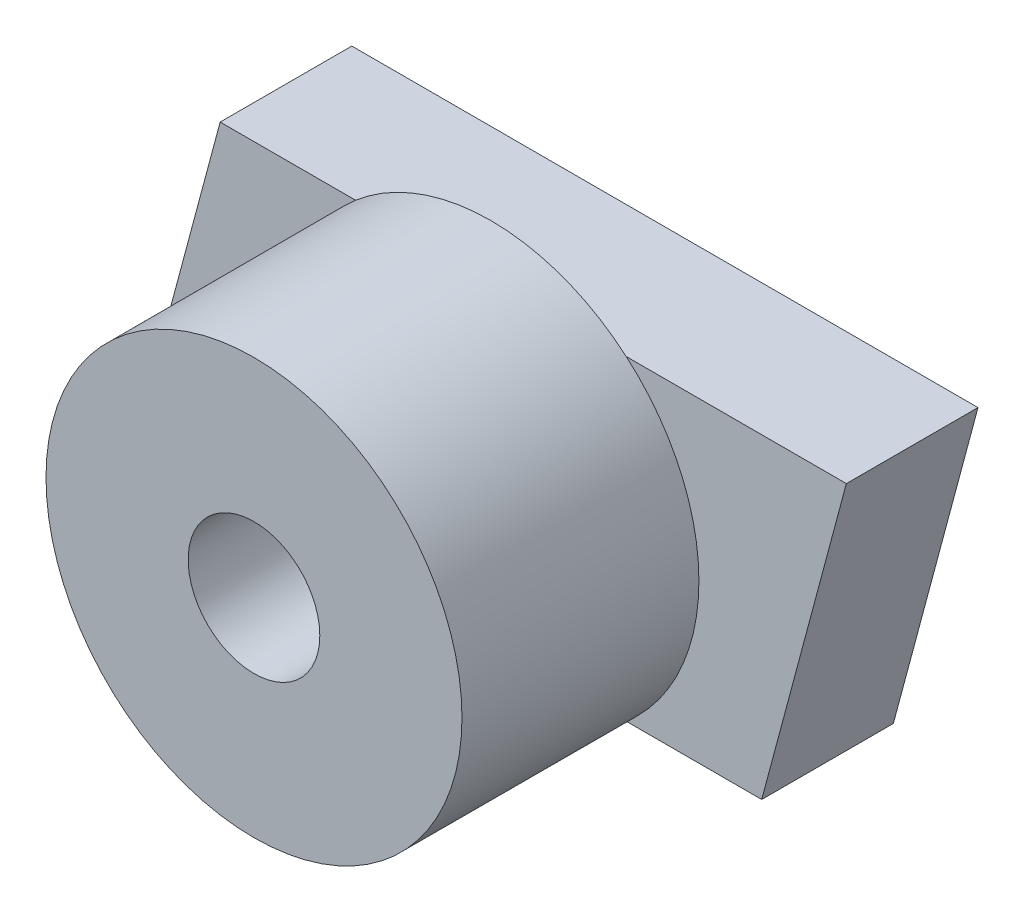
ISO-10303-21;
HEADER;
FILE_DESCRIPTION(('STEP AP214'),'2;1');
FILE_NAME('part.step','',(''),(''),'','','');
FILE_SCHEMA(('AUTOMOTIVE_DESIGN { 1 0 10303 214 1 1 1 1 }'));
ENDSEC;
DATA;
#1=APPLICATION_CONTEXT('core data for automotive mechanical design processes');
#2=APPLICATION_PROTOCOL_DEFINITION('international standard','automotive_design',2000,#1);
#3=PRODUCT_CONTEXT('',#1,'mechanical');
#4=PRODUCT('Part','Part','',(#3));
#5=PRODUCT_RELATED_PRODUCT_CATEGORY('part','',(#4));
#6=PRODUCT_DEFINITION_FORMATION('','',#4);
#7=PRODUCT_DEFINITION_CONTEXT('part definition',#1,'design');
#8=PRODUCT_DEFINITION('design','',#6,#7);
#9=PRODUCT_DEFINITION_SHAPE('','',#8);
#10=(LENGTH_UNIT() NAMED_UNIT(*) SI_UNIT(.MILLI.,.METRE.));
#11=(NAMED_UNIT(*) PLANE_ANGLE_UNIT() SI_UNIT($,.RADIAN.));
#12=(NAMED_UNIT(*) SI_UNIT($,.STERADIAN.) SOLID_ANGLE_UNIT());
#13=UNCERTAINTY_MEASURE_WITH_UNIT(LENGTH_MEASURE(1.E-05),#10,'distance_accuracy_value','');
#14=(GEOMETRIC_REPRESENTATION_CONTEXT(3) GLOBAL_UNCERTAINTY_ASSIGNED_CONTEXT((#13)) GLOBAL_UNIT_ASSIGNED_CONTEXT((#10,
#11,#12)) REPRESENTATION_CONTEXT('',''));
#15=CARTESIAN_POINT('',(0.,0.,0.));
#16=DIRECTION('',(0.,0.,1.));
#17=DIRECTION('',(1.,0.,0.));
#18=AXIS2_PLACEMENT_3D('',#15,#16,#17);
#19=CARTESIAN_POINT('',(-6.05198096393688,-0.400190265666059,-5.));
#20=DIRECTION('',(0.,0.,1.));
#21=DIRECTION('',(1.,0.,0.));
#22=AXIS2_PLACEMENT_3D('',#19,#20,#21);
#23=PLANE('',#22);
#24=CARTESIAN_POINT('',(0.,0.,-5.));
#25=DIRECTION('',(0.,0.,1.));
#26=DIRECTION('',(1.,0.,0.));
#27=AXIS2_PLACEMENT_3D('',#24,#25,#26);
#28=CIRCLE('',#27,2.5);
#29=CARTESIAN_POINT('',(2.5,0.,-5.));
#30=VERTEX_POINT('',#29);
#31=EDGE_CURVE('E88',#30,#30,#28,.T.);
#32=ORIENTED_EDGE('',*,*,#31,.T.);
#33=EDGE_LOOP('',(#32));
#34=FACE_BOUND('',#33,.T.);
#35=DIRECTION('',(-0.258819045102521,-0.965925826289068,0.));
#36=VECTOR('',#35,1.);
#37=CARTESIAN_POINT('',(-10.2846096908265,6.,-5.));
#38=LINE('',#37,#36);
#39=CARTESIAN_POINT('',(-10.2846096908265,6.,-5.));
#40=VERTEX_POINT('',#39);
#41=CARTESIAN_POINT('',(-13.5,-6.,-5.));
#42=VERTEX_POINT('',#41);
#43=EDGE_CURVE('E76',#40,#42,#38,.T.);
#44=ORIENTED_EDGE('',*,*,#43,.F.);
#45=DIRECTION('',(1.,0.,0.));
#46=VECTOR('',#45,1.);
#47=CARTESIAN_POINT('',(0.,6.,-5.));
#48=LINE('',#47,#46);
#49=CARTESIAN_POINT('',(13.5,6.,-5.));
#50=VERTEX_POINT('',#49);
#51=EDGE_CURVE('E72',#50,#40,#48,.F.);
#52=ORIENTED_EDGE('',*,*,#51,.F.);
#53=DIRECTION('',(0.258819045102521,0.965925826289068,0.));
#54=VECTOR('',#53,1.);
#55=CARTESIAN_POINT('',(10.2846096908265,-6.,-5.));
#56=LINE('',#55,#54);
#57=CARTESIAN_POINT('',(10.2846096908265,-6.,-5.));
#58=VERTEX_POINT('',#57);
#59=EDGE_CURVE('E74',#58,#50,#56,.T.);
#60=ORIENTED_EDGE('',*,*,#59,.F.);
#61=DIRECTION('',(1.,0.,0.));
#62=VECTOR('',#61,1.);
#63=CARTESIAN_POINT('',(-13.5,-6.,-5.));
#64=LINE('',#63,#62);
#65=EDGE_CURVE('E108',#42,#58,#64,.T.);
#66=ORIENTED_EDGE('',*,*,#65,.F.);
#67=EDGE_LOOP('',(#44,#52,#60,#66));
#68=FACE_BOUND('',#67,.T.);
#69=ADVANCED_FACE('F14',(#34,#68),#23,.F.);
#70=CARTESIAN_POINT('',(10.2846096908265,-6.,-5.));
#71=DIRECTION('',(0.965925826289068,-0.258819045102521,0.));
#72=DIRECTION('',(0.258819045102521,0.965925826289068,0.));
#73=AXIS2_PLACEMENT_3D('',#70,#71,#72);
#74=PLANE('',#73);
#75=DIRECTION('',(0.258819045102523,0.965925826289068,0.));
#76=VECTOR('',#75,1.);
#77=CARTESIAN_POINT('',(10.2846096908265,-6.,0.));
#78=LINE('',#77,#76);
#79=CARTESIAN_POINT('',(10.2846096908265,-6.,0.));
#80=VERTEX_POINT('',#79);
#81=CARTESIAN_POINT('',(13.5,6.,0.));
#82=VERTEX_POINT('',#81);
#83=EDGE_CURVE('E103',#80,#82,#78,.T.);
#84=ORIENTED_EDGE('',*,*,#83,.F.);
#85=DIRECTION('',(0.,0.,-1.));
#86=VECTOR('',#85,1.);
#87=CARTESIAN_POINT('',(10.2846096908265,-6.,-5.));
#88=LINE('',#87,#86);
#89=EDGE_CURVE('E86',#58,#80,#88,.F.);
#90=ORIENTED_EDGE('',*,*,#89,.F.);
#91=ORIENTED_EDGE('',*,*,#59,.T.);
#92=DIRECTION('',(0.,0.,1.));
#93=VECTOR('',#92,1.);
#94=CARTESIAN_POINT('',(13.5,6.,-5.));
#95=LINE('',#94,#93);
#96=EDGE_CURVE('E80',#82,#50,#95,.F.);
#97=ORIENTED_EDGE('',*,*,#96,.F.);
#98=EDGE_LOOP('',(#84,#90,#91,#97));
#99=FACE_BOUND('',#98,.T.);
#100=ADVANCED_FACE('F84',(#99),#74,.T.);
#101=CARTESIAN_POINT('',(0.,6.,-5.));
#102=DIRECTION('',(0.,1.,0.));
#103=DIRECTION('',(0.,0.,1.));
#104=AXIS2_PLACEMENT_3D('',#101,#102,#103);
#105=PLANE('',#104);
#106=DIRECTION('',(1.,0.,0.));
#107=VECTOR('',#106,1.);
#108=CARTESIAN_POINT('',(-6.05198096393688,6.,0.));
#109=LINE('',#108,#107);
#110=CARTESIAN_POINT('',(5.13906606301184,6.,0.));
#111=VERTEX_POINT('',#110);
#112=EDGE_CURVE('E92',#82,#111,#109,.F.);
#113=ORIENTED_EDGE('',*,*,#112,.F.);
#114=ORIENTED_EDGE('',*,*,#96,.T.);
#115=ORIENTED_EDGE('',*,*,#51,.T.);
#116=DIRECTION('',(0.,0.,1.));
#117=VECTOR('',#116,1.);
#118=CARTESIAN_POINT('',(-10.2846096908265,6.,-5.));
#119=LINE('',#118,#117);
#120=CARTESIAN_POINT('',(-10.2846096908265,6.,0.));
#121=VERTEX_POINT('',#120);
#122=EDGE_CURVE('E95',#121,#40,#119,.F.);
#123=ORIENTED_EDGE('',*,*,#122,.F.);
#124=DIRECTION('',(1.,0.,0.));
#125=VECTOR('',#124,1.);
#126=CARTESIAN_POINT('',(-6.05198096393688,6.,0.));
#127=LINE('',#126,#125);
#128=CARTESIAN_POINT('',(-5.13906606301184,6.,0.));
#129=VERTEX_POINT('',#128);
#130=EDGE_CURVE('E139',#129,#121,#127,.F.);
#131=ORIENTED_EDGE('',*,*,#130,.F.);
#132=DIRECTION('',(1.,0.,0.));
#133=VECTOR('',#132,1.);
#134=CARTESIAN_POINT('',(0.,6.,0.));
#135=LINE('',#134,#133);
#136=EDGE_CURVE('E142',#129,#111,#135,.T.);
#137=ORIENTED_EDGE('',*,*,#136,.T.);
#138=EDGE_LOOP('',(#113,#114,#115,#123,#131,#137));
#139=FACE_BOUND('',#138,.T.);
#140=ADVANCED_FACE('F90',(#139),#105,.T.);
#141=CARTESIAN_POINT('',(-10.2846096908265,6.,-5.));
#142=DIRECTION('',(-0.965925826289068,0.258819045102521,0.));
#143=DIRECTION('',(-0.258819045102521,-0.965925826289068,0.));
#144=AXIS2_PLACEMENT_3D('',#141,#142,#143);
#145=PLANE('',#144);
#146=DIRECTION('',(-0.258819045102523,-0.965925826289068,0.));
#147=VECTOR('',#146,1.);
#148=CARTESIAN_POINT('',(-10.2846096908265,6.,0.));
#149=LINE('',#148,#147);
#150=CARTESIAN_POINT('',(-13.5,-6.,0.));
#151=VERTEX_POINT('',#150);
#152=EDGE_CURVE('E132',#121,#151,#149,.T.);
#153=ORIENTED_EDGE('',*,*,#152,.F.);
#154=ORIENTED_EDGE('',*,*,#122,.T.);
#155=ORIENTED_EDGE('',*,*,#43,.T.);
#156=DIRECTION('',(0.,0.,-1.));
#157=VECTOR('',#156,1.);
#158=CARTESIAN_POINT('',(-13.5,-6.,-5.));
#159=LINE('',#158,#157);
#160=EDGE_CURVE('E53',#151,#42,#159,.T.);
#161=ORIENTED_EDGE('',*,*,#160,.F.);
#162=EDGE_LOOP('',(#153,#154,#155,#161));
#163=FACE_BOUND('',#162,.T.);
#164=ADVANCED_FACE('F158',(#163),#145,.T.);
#165=CARTESIAN_POINT('',(-13.5,-6.,-5.));
#166=DIRECTION('',(0.,-1.,0.));
#167=DIRECTION('',(0.,0.,-1.));
#168=AXIS2_PLACEMENT_3D('',#165,#166,#167);
#169=PLANE('',#168);
#170=DIRECTION('',(1.,0.,0.));
#171=VECTOR('',#170,1.);
#172=CARTESIAN_POINT('',(-6.05198096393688,-6.,0.));
#173=LINE('',#172,#171);
#174=CARTESIAN_POINT('',(-5.13906606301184,-6.,0.));
#175=VERTEX_POINT('',#174);
#176=EDGE_CURVE('E130',#151,#175,#173,.T.);
#177=ORIENTED_EDGE('',*,*,#176,.F.);
#178=ORIENTED_EDGE('',*,*,#160,.T.);
#179=ORIENTED_EDGE('',*,*,#65,.T.);
#180=ORIENTED_EDGE('',*,*,#89,.T.);
#181=DIRECTION('',(1.,0.,0.));
#182=VECTOR('',#181,1.);
#183=CARTESIAN_POINT('',(-6.05198096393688,-6.,0.));
#184=LINE('',#183,#182);
#185=CARTESIAN_POINT('',(5.13906606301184,-6.,0.));
#186=VERTEX_POINT('',#185);
#187=EDGE_CURVE('E43',#186,#80,#184,.T.);
#188=ORIENTED_EDGE('',*,*,#187,.F.);
#189=DIRECTION('',(1.,0.,0.));
#190=VECTOR('',#189,1.);
#191=CARTESIAN_POINT('',(0.,-6.,0.));
#192=LINE('',#191,#190);
#193=EDGE_CURVE('E32',#186,#175,#192,.F.);
#194=ORIENTED_EDGE('',*,*,#193,.T.);
#195=EDGE_LOOP('',(#177,#178,#179,#180,#188,#194));
#196=FACE_BOUND('',#195,.T.);
#197=ADVANCED_FACE('F194',(#196),#169,.T.);
#198=CARTESIAN_POINT('',(0.,0.,9.));
#199=DIRECTION('',(0.,0.,1.));
#200=DIRECTION('',(1.,0.,0.));
#201=AXIS2_PLACEMENT_3D('',#198,#199,#200);
#202=PLANE('',#201);
#203=CARTESIAN_POINT('',(0.,0.,9.));
#204=DIRECTION('',(0.,0.,1.));
#205=DIRECTION('',(1.,0.,0.));
#206=AXIS2_PLACEMENT_3D('',#203,#204,#205);
#207=CIRCLE('',#206,2.5);
#208=CARTESIAN_POINT('',(2.5,0.,9.));
#209=VERTEX_POINT('',#208);
#210=EDGE_CURVE('E213',#209,#209,#207,.T.);
#211=ORIENTED_EDGE('',*,*,#210,.F.);
#212=EDGE_LOOP('',(#211));
#213=FACE_BOUND('',#212,.T.);
#214=CARTESIAN_POINT('',(0.,0.,9.));
#215=DIRECTION('',(0.,0.,1.));
#216=DIRECTION('',(1.,0.,0.));
#217=AXIS2_PLACEMENT_3D('',#214,#215,#216);
#218=CIRCLE('',#217,7.9);
#219=CARTESIAN_POINT('',(7.9,0.,9.));
#220=VERTEX_POINT('',#219);
#221=EDGE_CURVE('E17',#220,#220,#218,.F.);
#222=ORIENTED_EDGE('',*,*,#221,.F.);
#223=EDGE_LOOP('',(#222));
#224=FACE_BOUND('',#223,.T.);
#225=ADVANCED_FACE('F190',(#213,#224),#202,.T.);
#226=CARTESIAN_POINT('',(-6.05198096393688,-0.400190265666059,0.));
#227=DIRECTION('',(0.,0.,1.));
#228=DIRECTION('',(1.,0.,0.));
#229=AXIS2_PLACEMENT_3D('',#226,#227,#228);
#230=PLANE('',#229);
#231=ORIENTED_EDGE('',*,*,#83,.T.);
#232=ORIENTED_EDGE('',*,*,#112,.T.);
#233=CARTESIAN_POINT('',(0.,0.,0.));
#234=DIRECTION('',(0.,0.,1.));
#235=DIRECTION('',(1.,0.,0.));
#236=AXIS2_PLACEMENT_3D('',#233,#234,#235);
#237=CIRCLE('',#236,7.9);
#238=EDGE_CURVE('E124',#186,#111,#237,.T.);
#239=ORIENTED_EDGE('',*,*,#238,.F.);
#240=ORIENTED_EDGE('',*,*,#187,.T.);
#241=EDGE_LOOP('',(#231,#232,#239,#240));
#242=FACE_BOUND('',#241,.T.);
#243=ADVANCED_FACE('F187',(#242),#230,.T.);
#244=CARTESIAN_POINT('',(0.,0.,0.));
#245=DIRECTION('',(0.,0.,1.));
#246=DIRECTION('',(1.,0.,0.));
#247=AXIS2_PLACEMENT_3D('',#244,#245,#246);
#248=PLANE('',#247);
#249=CARTESIAN_POINT('',(0.,0.,0.));
#250=DIRECTION('',(0.,0.,1.));
#251=DIRECTION('',(1.,0.,0.));
#252=AXIS2_PLACEMENT_3D('',#249,#250,#251);
#253=CIRCLE('',#252,7.9);
#254=EDGE_CURVE('E122',#111,#129,#253,.T.);
#255=ORIENTED_EDGE('',*,*,#254,.F.);
#256=ORIENTED_EDGE('',*,*,#136,.F.);
#257=EDGE_LOOP('',(#255,#256));
#258=FACE_BOUND('',#257,.T.);
#259=ADVANCED_FACE('F164',(#258),#248,.F.);
#260=CARTESIAN_POINT('',(-6.05198096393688,-0.400190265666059,0.));
#261=DIRECTION('',(0.,0.,1.));
#262=DIRECTION('',(1.,0.,0.));
#263=AXIS2_PLACEMENT_3D('',#260,#261,#262);
#264=PLANE('',#263);
#265=ORIENTED_EDGE('',*,*,#152,.T.);
#266=ORIENTED_EDGE('',*,*,#176,.T.);
#267=CARTESIAN_POINT('',(0.,0.,0.));
#268=DIRECTION('',(0.,0.,1.));
#269=DIRECTION('',(1.,0.,0.));
#270=AXIS2_PLACEMENT_3D('',#267,#268,#269);
#271=CIRCLE('',#270,7.9);
#272=EDGE_CURVE('E23',#129,#175,#271,.T.);
#273=ORIENTED_EDGE('',*,*,#272,.F.);
#274=ORIENTED_EDGE('',*,*,#130,.T.);
#275=EDGE_LOOP('',(#265,#266,#273,#274));
#276=FACE_BOUND('',#275,.T.);
#277=ADVANCED_FACE('F165',(#276),#264,.T.);
#278=CARTESIAN_POINT('',(0.,0.,0.));
#279=DIRECTION('',(0.,0.,1.));
#280=DIRECTION('',(1.,0.,0.));
#281=AXIS2_PLACEMENT_3D('',#278,#279,#280);
#282=PLANE('',#281);
#283=CARTESIAN_POINT('',(0.,0.,0.));
#284=DIRECTION('',(0.,0.,1.));
#285=DIRECTION('',(1.,0.,0.));
#286=AXIS2_PLACEMENT_3D('',#283,#284,#285);
#287=CIRCLE('',#286,7.9);
#288=EDGE_CURVE('E9',#175,#186,#287,.T.);
#289=ORIENTED_EDGE('',*,*,#288,.F.);
#290=ORIENTED_EDGE('',*,*,#193,.F.);
#291=EDGE_LOOP('',(#289,#290));
#292=FACE_BOUND('',#291,.T.);
#293=ADVANCED_FACE('F170',(#292),#282,.F.);
#294=CARTESIAN_POINT('',(0.,0.,0.));
#295=DIRECTION('',(0.,0.,1.));
#296=DIRECTION('',(1.,0.,0.));
#297=AXIS2_PLACEMENT_3D('',#294,#295,#296);
#298=CYLINDRICAL_SURFACE('',#297,7.9);
#299=ORIENTED_EDGE('',*,*,#272,.T.);
#300=ORIENTED_EDGE('',*,*,#288,.T.);
#301=ORIENTED_EDGE('',*,*,#238,.T.);
#302=ORIENTED_EDGE('',*,*,#254,.T.);
#303=EDGE_LOOP('',(#299,#300,#301,#302));
#304=FACE_BOUND('',#303,.T.);
#305=ORIENTED_EDGE('',*,*,#221,.T.);
#306=EDGE_LOOP('',(#305));
#307=FACE_BOUND('',#306,.T.);
#308=ADVANCED_FACE('F167',(#304,#307),#298,.T.);
#309=CARTESIAN_POINT('',(0.,0.,-5.00010307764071));
#310=DIRECTION('',(0.,0.,1.));
#311=DIRECTION('',(1.,0.,0.));
#312=AXIS2_PLACEMENT_3D('',#309,#310,#311);
#313=CYLINDRICAL_SURFACE('',#312,2.5);
#314=ORIENTED_EDGE('',*,*,#210,.T.);
#315=EDGE_LOOP('',(#314));
#316=FACE_BOUND('',#315,.T.);
#317=ORIENTED_EDGE('',*,*,#31,.F.);
#318=EDGE_LOOP('',(#317));
#319=FACE_BOUND('',#318,.T.);
#320=ADVANCED_FACE('F169',(#316,#319),#313,.F.);
#321=CLOSED_SHELL('',(#69,#100,#140,#164,#197,#225,#243,#259,#277,#293,#308,#320));
#322=MANIFOLD_SOLID_BREP('B1',#321);
#323=ADVANCED_BREP_SHAPE_REPRESENTATION('',(#18,#322),#14);
#324=SHAPE_DEFINITION_REPRESENTATION(#9,#323);
ENDSEC;
END-ISO-10303-21;
